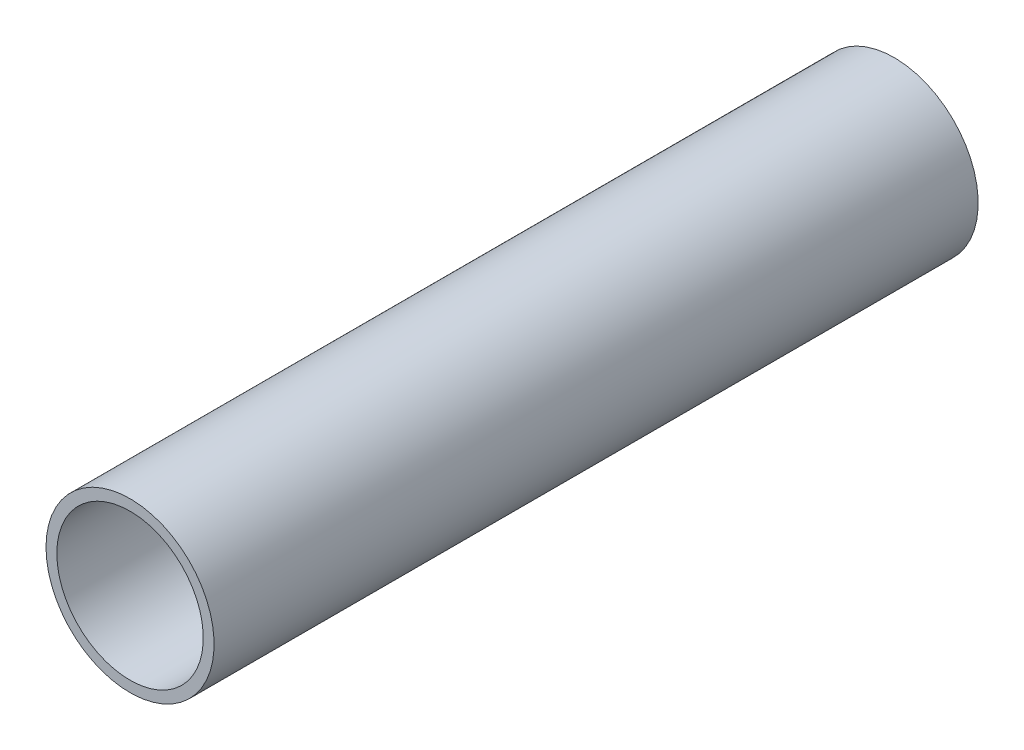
ISO-10303-21;
HEADER;
FILE_DESCRIPTION(('STEP AP214'),'2;1');
FILE_NAME('part.step','',(''),(''),'','','');
FILE_SCHEMA(('AUTOMOTIVE_DESIGN { 1 0 10303 214 1 1 1 1 }'));
ENDSEC;
DATA;
#1=APPLICATION_CONTEXT('core data for automotive mechanical design processes');
#2=APPLICATION_PROTOCOL_DEFINITION('international standard','automotive_design',2000,#1);
#3=PRODUCT_CONTEXT('',#1,'mechanical');
#4=PRODUCT('Part','Part','',(#3));
#5=PRODUCT_RELATED_PRODUCT_CATEGORY('part','',(#4));
#6=PRODUCT_DEFINITION_FORMATION('','',#4);
#7=PRODUCT_DEFINITION_CONTEXT('part definition',#1,'design');
#8=PRODUCT_DEFINITION('design','',#6,#7);
#9=PRODUCT_DEFINITION_SHAPE('','',#8);
#10=(LENGTH_UNIT() NAMED_UNIT(*) SI_UNIT(.MILLI.,.METRE.));
#11=(NAMED_UNIT(*) PLANE_ANGLE_UNIT() SI_UNIT($,.RADIAN.));
#12=(NAMED_UNIT(*) SI_UNIT($,.STERADIAN.) SOLID_ANGLE_UNIT());
#13=UNCERTAINTY_MEASURE_WITH_UNIT(LENGTH_MEASURE(1.E-05),#10,'distance_accuracy_value','');
#14=(GEOMETRIC_REPRESENTATION_CONTEXT(3) GLOBAL_UNCERTAINTY_ASSIGNED_CONTEXT((#13)) GLOBAL_UNIT_ASSIGNED_CONTEXT((#10,
#11,#12)) REPRESENTATION_CONTEXT('',''));
#15=CARTESIAN_POINT('',(0.,0.,0.));
#16=DIRECTION('',(0.,0.,1.));
#17=DIRECTION('',(1.,0.,0.));
#18=AXIS2_PLACEMENT_3D('',#15,#16,#17);
#19=CARTESIAN_POINT('',(0.,1.11022302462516E-13,152.4));
#20=DIRECTION('',(0.,0.,0.999999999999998));
#21=DIRECTION('',(1.,0.,0.));
#22=AXIS2_PLACEMENT_3D('',#19,#20,#21);
#23=PLANE('',#22);
#24=CARTESIAN_POINT('',(0.,1.11022302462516E-13,152.4));
#25=DIRECTION('',(0.,0.,0.999999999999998));
#26=DIRECTION('',(1.,0.,0.));
#27=AXIS2_PLACEMENT_3D('',#24,#25,#26);
#28=CIRCLE('',#27,16.764);
#29=CARTESIAN_POINT('',(-16.764,1.10557007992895E-13,152.4));
#30=VERTEX_POINT('',#29);
#31=EDGE_CURVE('E12',#30,#30,#28,.T.);
#32=ORIENTED_EDGE('',*,*,#31,.T.);
#33=EDGE_LOOP('',(#32));
#34=FACE_BOUND('',#33,.T.);
#35=CARTESIAN_POINT('',(0.,1.11022302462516E-13,152.4));
#36=DIRECTION('',(0.,0.,0.999999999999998));
#37=DIRECTION('',(1.,0.,0.));
#38=AXIS2_PLACEMENT_3D('',#35,#36,#37);
#39=CIRCLE('',#38,14.605);
#40=CARTESIAN_POINT('',(-14.605,1.10616932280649E-13,152.4));
#41=VERTEX_POINT('',#40);
#42=EDGE_CURVE('E58',#41,#41,#39,.T.);
#43=ORIENTED_EDGE('',*,*,#42,.F.);
#44=EDGE_LOOP('',(#43));
#45=FACE_BOUND('',#44,.T.);
#46=ADVANCED_FACE('F44',(#34,#45),#23,.T.);
#47=CARTESIAN_POINT('',(0.,0.,0.));
#48=DIRECTION('',(0.,0.,0.999999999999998));
#49=DIRECTION('',(1.,0.,0.));
#50=AXIS2_PLACEMENT_3D('',#47,#48,#49);
#51=PLANE('',#50);
#52=CARTESIAN_POINT('',(0.,0.,0.));
#53=DIRECTION('',(0.,0.,0.999999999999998));
#54=DIRECTION('',(1.,0.,0.));
#55=AXIS2_PLACEMENT_3D('',#52,#53,#54);
#56=CIRCLE('',#55,16.764);
#57=CARTESIAN_POINT('',(-16.764,1.10557007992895E-13,0.));
#58=VERTEX_POINT('',#57);
#59=EDGE_CURVE('E48',#58,#58,#56,.T.);
#60=ORIENTED_EDGE('',*,*,#59,.F.);
#61=EDGE_LOOP('',(#60));
#62=FACE_BOUND('',#61,.T.);
#63=CARTESIAN_POINT('',(0.,0.,0.));
#64=DIRECTION('',(0.,0.,0.999999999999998));
#65=DIRECTION('',(1.,0.,0.));
#66=AXIS2_PLACEMENT_3D('',#63,#64,#65);
#67=CIRCLE('',#66,14.605);
#68=CARTESIAN_POINT('',(-14.605,1.10616932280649E-13,0.));
#69=VERTEX_POINT('',#68);
#70=EDGE_CURVE('E60',#69,#69,#67,.T.);
#71=ORIENTED_EDGE('',*,*,#70,.T.);
#72=EDGE_LOOP('',(#71));
#73=FACE_BOUND('',#72,.T.);
#74=ADVANCED_FACE('F73',(#62,#73),#51,.F.);
#75=CARTESIAN_POINT('',(0.,1.11022302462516E-13,152.4));
#76=DIRECTION('',(0.,0.,-0.999999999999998));
#77=DIRECTION('',(-1.,0.,0.));
#78=AXIS2_PLACEMENT_3D('',#75,#76,#77);
#79=CYLINDRICAL_SURFACE('',#78,16.764);
#80=CARTESIAN_POINT('',(-16.764,1.10557007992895E-13,152.4));
#81=CARTESIAN_POINT('',(-16.764,1.10557007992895E-13,150.8125));
#82=CARTESIAN_POINT('',(-16.764,1.10557007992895E-13,149.225));
#83=CARTESIAN_POINT('',(-16.764,1.10557007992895E-13,146.05));
#84=CARTESIAN_POINT('',(-16.764,1.10557007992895E-13,144.4625));
#85=CARTESIAN_POINT('',(-16.764,1.10557007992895E-13,141.2875));
#86=CARTESIAN_POINT('',(-16.764,1.10557007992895E-13,139.7));
#87=CARTESIAN_POINT('',(-16.764,1.10557007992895E-13,136.525));
#88=CARTESIAN_POINT('',(-16.764,1.10557007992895E-13,134.9375));
#89=CARTESIAN_POINT('',(-16.764,1.10557007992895E-13,131.7625));
#90=CARTESIAN_POINT('',(-16.764,1.10557007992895E-13,130.175));
#91=CARTESIAN_POINT('',(-16.764,1.10557007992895E-13,127.));
#92=CARTESIAN_POINT('',(-16.764,1.10557007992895E-13,125.4125));
#93=CARTESIAN_POINT('',(-16.764,1.10557007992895E-13,122.2375));
#94=CARTESIAN_POINT('',(-16.764,1.10557007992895E-13,120.65));
#95=CARTESIAN_POINT('',(-16.764,1.10557007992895E-13,117.475));
#96=CARTESIAN_POINT('',(-16.764,1.10557007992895E-13,115.8875));
#97=CARTESIAN_POINT('',(-16.764,1.10557007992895E-13,112.7125));
#98=CARTESIAN_POINT('',(-16.764,1.10557007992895E-13,111.125));
#99=CARTESIAN_POINT('',(-16.764,1.10557007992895E-13,107.95));
#100=CARTESIAN_POINT('',(-16.764,1.10557007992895E-13,106.3625));
#101=CARTESIAN_POINT('',(-16.764,1.10557007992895E-13,103.1875));
#102=CARTESIAN_POINT('',(-16.764,1.10557007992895E-13,101.6));
#103=CARTESIAN_POINT('',(-16.764,1.10557007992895E-13,98.4249999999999));
#104=CARTESIAN_POINT('',(-16.764,1.10557007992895E-13,96.8374999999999));
#105=CARTESIAN_POINT('',(-16.764,1.10557007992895E-13,93.6625));
#106=CARTESIAN_POINT('',(-16.764,1.10557007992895E-13,92.0749999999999));
#107=CARTESIAN_POINT('',(-16.764,1.10557007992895E-13,88.8999999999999));
#108=CARTESIAN_POINT('',(-16.764,1.10557007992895E-13,87.3125));
#109=CARTESIAN_POINT('',(-16.764,1.10557007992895E-13,84.1375));
#110=CARTESIAN_POINT('',(-16.764,1.10557007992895E-13,82.55));
#111=CARTESIAN_POINT('',(-16.764,1.10557007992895E-13,79.375));
#112=CARTESIAN_POINT('',(-16.764,1.10557007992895E-13,77.7875));
#113=CARTESIAN_POINT('',(-16.764,1.10557007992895E-13,74.6125));
#114=CARTESIAN_POINT('',(-16.764,1.10557007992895E-13,73.025));
#115=CARTESIAN_POINT('',(-16.764,1.10557007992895E-13,69.85));
#116=CARTESIAN_POINT('',(-16.764,1.10557007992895E-13,68.2625));
#117=CARTESIAN_POINT('',(-16.764,1.10557007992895E-13,65.0875));
#118=CARTESIAN_POINT('',(-16.764,1.10557007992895E-13,63.5));
#119=CARTESIAN_POINT('',(-16.764,1.10557007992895E-13,60.325));
#120=CARTESIAN_POINT('',(-16.764,1.10557007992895E-13,58.7375));
#121=CARTESIAN_POINT('',(-16.764,1.10557007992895E-13,55.5625));
#122=CARTESIAN_POINT('',(-16.764,1.10557007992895E-13,53.975));
#123=CARTESIAN_POINT('',(-16.764,1.10557007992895E-13,50.8));
#124=CARTESIAN_POINT('',(-16.764,1.10557007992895E-13,49.2125));
#125=CARTESIAN_POINT('',(-16.764,1.10557007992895E-13,46.0375));
#126=CARTESIAN_POINT('',(-16.764,1.10557007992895E-13,44.45));
#127=CARTESIAN_POINT('',(-16.764,1.10557007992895E-13,41.275));
#128=CARTESIAN_POINT('',(-16.764,1.10557007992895E-13,39.6875));
#129=CARTESIAN_POINT('',(-16.764,1.10557007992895E-13,36.5125));
#130=CARTESIAN_POINT('',(-16.764,1.10557007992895E-13,34.925));
#131=CARTESIAN_POINT('',(-16.764,1.10557007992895E-13,31.75));
#132=CARTESIAN_POINT('',(-16.764,1.10557007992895E-13,30.1625));
#133=CARTESIAN_POINT('',(-16.764,1.10557007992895E-13,26.9875));
#134=CARTESIAN_POINT('',(-16.764,1.10557007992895E-13,25.4));
#135=CARTESIAN_POINT('',(-16.764,1.10557007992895E-13,22.225));
#136=CARTESIAN_POINT('',(-16.764,1.10557007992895E-13,20.6375));
#137=CARTESIAN_POINT('',(-16.764,1.10557007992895E-13,17.4625));
#138=CARTESIAN_POINT('',(-16.764,1.10557007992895E-13,15.875));
#139=CARTESIAN_POINT('',(-16.764,1.10557007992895E-13,12.7));
#140=CARTESIAN_POINT('',(-16.764,1.10557007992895E-13,11.1125));
#141=CARTESIAN_POINT('',(-16.764,1.10557007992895E-13,7.93750000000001));
#142=CARTESIAN_POINT('',(-16.764,1.10557007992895E-13,6.35));
#143=CARTESIAN_POINT('',(-16.764,1.10557007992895E-13,3.175));
#144=CARTESIAN_POINT('',(-16.764,1.10557007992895E-13,1.5875));
#145=CARTESIAN_POINT('',(-16.764,1.10557007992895E-13,0.));
#146=B_SPLINE_CURVE_WITH_KNOTS('',3,(#80,#81,#82,#83,#84,#85,#86,#87,#88,#89,#90,#91,#92,#93,
#94,#95,#96,#97,#98,#99,#100,#101,#102,#103,#104,#105,#106,#107,#108,#109,#110,#111,#112,#113,
#114,#115,#116,#117,#118,#119,#120,#121,#122,#123,#124,#125,#126,#127,#128,#129,#130,#131,#132,
#133,#134,#135,#136,#137,#138,#139,#140,#141,#142,#143,#144,#145),.UNSPECIFIED.,.F.,.F.,(4,2,2,
2,2,2,2,2,2,2,2,2,2,2,2,2,2,2,2,2,2,2,2,2,2,2,2,2,2,2,2,2,4),(0.,4.76249999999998,
9.52499999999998,14.2875,19.05,23.8125,28.575,33.3375,38.1,42.8625,47.6249999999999,
52.3874999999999,57.1499999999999,61.9124999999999,66.6749999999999,71.4374999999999,
76.1999999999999,80.9624999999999,85.7249999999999,90.4874999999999,95.2499999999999,100.0125,
104.775,109.5375,114.3,119.0625,123.825,128.5875,133.35,138.1125,142.875,147.6375,152.4),.UNSPECIFIED.);
#147=EDGE_CURVE('BSEAM46',#30,#58,#146,.T.);
#148=ORIENTED_EDGE('',*,*,#31,.F.);
#149=ORIENTED_EDGE('',*,*,#59,.T.);
#150=ORIENTED_EDGE('',*,*,#147,.T.);
#151=ORIENTED_EDGE('',*,*,#147,.F.);
#152=EDGE_LOOP('',(#148,#150,#149,#151));
#153=FACE_BOUND('',#152,.T.);
#154=ADVANCED_FACE('F46',(#153),#79,.T.);
#155=CARTESIAN_POINT('',(0.,1.11022302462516E-13,152.4));
#156=DIRECTION('',(0.,0.,-0.999999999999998));
#157=DIRECTION('',(-1.,0.,0.));
#158=AXIS2_PLACEMENT_3D('',#155,#156,#157);
#159=CYLINDRICAL_SURFACE('',#158,14.605);
#160=CARTESIAN_POINT('',(-14.605,1.10616932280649E-13,152.4));
#161=CARTESIAN_POINT('',(-14.605,1.10616932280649E-13,150.8125));
#162=CARTESIAN_POINT('',(-14.605,1.10616932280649E-13,149.225));
#163=CARTESIAN_POINT('',(-14.605,1.10616932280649E-13,146.05));
#164=CARTESIAN_POINT('',(-14.605,1.10616932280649E-13,144.4625));
#165=CARTESIAN_POINT('',(-14.605,1.10616932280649E-13,141.2875));
#166=CARTESIAN_POINT('',(-14.605,1.10616932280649E-13,139.7));
#167=CARTESIAN_POINT('',(-14.605,1.10616932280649E-13,136.525));
#168=CARTESIAN_POINT('',(-14.605,1.10616932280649E-13,134.9375));
#169=CARTESIAN_POINT('',(-14.605,1.10616932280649E-13,131.7625));
#170=CARTESIAN_POINT('',(-14.605,1.10616932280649E-13,130.175));
#171=CARTESIAN_POINT('',(-14.605,1.10616932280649E-13,127.));
#172=CARTESIAN_POINT('',(-14.605,1.10616932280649E-13,125.4125));
#173=CARTESIAN_POINT('',(-14.605,1.10616932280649E-13,122.2375));
#174=CARTESIAN_POINT('',(-14.605,1.10616932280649E-13,120.65));
#175=CARTESIAN_POINT('',(-14.605,1.10616932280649E-13,117.475));
#176=CARTESIAN_POINT('',(-14.605,1.10616932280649E-13,115.8875));
#177=CARTESIAN_POINT('',(-14.605,1.10616932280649E-13,112.7125));
#178=CARTESIAN_POINT('',(-14.605,1.10616932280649E-13,111.125));
#179=CARTESIAN_POINT('',(-14.605,1.10616932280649E-13,107.95));
#180=CARTESIAN_POINT('',(-14.605,1.10616932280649E-13,106.3625));
#181=CARTESIAN_POINT('',(-14.605,1.10616932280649E-13,103.1875));
#182=CARTESIAN_POINT('',(-14.605,1.10616932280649E-13,101.6));
#183=CARTESIAN_POINT('',(-14.605,1.10616932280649E-13,98.4249999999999));
#184=CARTESIAN_POINT('',(-14.605,1.10616932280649E-13,96.8374999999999));
#185=CARTESIAN_POINT('',(-14.605,1.10616932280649E-13,93.6625));
#186=CARTESIAN_POINT('',(-14.605,1.10616932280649E-13,92.0749999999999));
#187=CARTESIAN_POINT('',(-14.605,1.10616932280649E-13,88.8999999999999));
#188=CARTESIAN_POINT('',(-14.605,1.10616932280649E-13,87.3125));
#189=CARTESIAN_POINT('',(-14.605,1.10616932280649E-13,84.1375));
#190=CARTESIAN_POINT('',(-14.605,1.10616932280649E-13,82.55));
#191=CARTESIAN_POINT('',(-14.605,1.10616932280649E-13,79.375));
#192=CARTESIAN_POINT('',(-14.605,1.10616932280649E-13,77.7875));
#193=CARTESIAN_POINT('',(-14.605,1.10616932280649E-13,74.6125));
#194=CARTESIAN_POINT('',(-14.605,1.10616932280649E-13,73.025));
#195=CARTESIAN_POINT('',(-14.605,1.10616932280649E-13,69.85));
#196=CARTESIAN_POINT('',(-14.605,1.10616932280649E-13,68.2625));
#197=CARTESIAN_POINT('',(-14.605,1.10616932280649E-13,65.0875));
#198=CARTESIAN_POINT('',(-14.605,1.10616932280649E-13,63.5));
#199=CARTESIAN_POINT('',(-14.605,1.10616932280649E-13,60.325));
#200=CARTESIAN_POINT('',(-14.605,1.10616932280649E-13,58.7375));
#201=CARTESIAN_POINT('',(-14.605,1.10616932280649E-13,55.5625));
#202=CARTESIAN_POINT('',(-14.605,1.10616932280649E-13,53.975));
#203=CARTESIAN_POINT('',(-14.605,1.10616932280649E-13,50.8));
#204=CARTESIAN_POINT('',(-14.605,1.10616932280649E-13,49.2125));
#205=CARTESIAN_POINT('',(-14.605,1.10616932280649E-13,46.0375));
#206=CARTESIAN_POINT('',(-14.605,1.10616932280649E-13,44.45));
#207=CARTESIAN_POINT('',(-14.605,1.10616932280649E-13,41.275));
#208=CARTESIAN_POINT('',(-14.605,1.10616932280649E-13,39.6875));
#209=CARTESIAN_POINT('',(-14.605,1.10616932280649E-13,36.5125));
#210=CARTESIAN_POINT('',(-14.605,1.10616932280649E-13,34.925));
#211=CARTESIAN_POINT('',(-14.605,1.10616932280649E-13,31.75));
#212=CARTESIAN_POINT('',(-14.605,1.10616932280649E-13,30.1625));
#213=CARTESIAN_POINT('',(-14.605,1.10616932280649E-13,26.9875));
#214=CARTESIAN_POINT('',(-14.605,1.10616932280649E-13,25.4));
#215=CARTESIAN_POINT('',(-14.605,1.10616932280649E-13,22.225));
#216=CARTESIAN_POINT('',(-14.605,1.10616932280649E-13,20.6375));
#217=CARTESIAN_POINT('',(-14.605,1.10616932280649E-13,17.4625));
#218=CARTESIAN_POINT('',(-14.605,1.10616932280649E-13,15.875));
#219=CARTESIAN_POINT('',(-14.605,1.10616932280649E-13,12.7));
#220=CARTESIAN_POINT('',(-14.605,1.10616932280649E-13,11.1125));
#221=CARTESIAN_POINT('',(-14.605,1.10616932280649E-13,7.93750000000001));
#222=CARTESIAN_POINT('',(-14.605,1.10616932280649E-13,6.35));
#223=CARTESIAN_POINT('',(-14.605,1.10616932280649E-13,3.175));
#224=CARTESIAN_POINT('',(-14.605,1.10616932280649E-13,1.5875));
#225=CARTESIAN_POINT('',(-14.605,1.10616932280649E-13,0.));
#226=B_SPLINE_CURVE_WITH_KNOTS('',3,(#160,#161,#162,#163,#164,#165,#166,#167,#168,#169,#170,
#171,#172,#173,#174,#175,#176,#177,#178,#179,#180,#181,#182,#183,#184,#185,#186,#187,#188,#189,
#190,#191,#192,#193,#194,#195,#196,#197,#198,#199,#200,#201,#202,#203,#204,#205,#206,#207,#208,
#209,#210,#211,#212,#213,#214,#215,#216,#217,#218,#219,#220,#221,#222,#223,#224,#225),
.UNSPECIFIED.,.F.,.F.,(4,2,2,2,2,2,2,2,2,2,2,2,2,2,2,2,2,2,2,2,2,2,2,2,2,2,2,2,2,2,2,2,4),(0.,
4.76249999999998,9.52499999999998,14.2875,19.05,23.8125,28.575,33.3375,38.1,42.8625,
47.6249999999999,52.3874999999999,57.1499999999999,61.9124999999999,66.6749999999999,
71.4374999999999,76.1999999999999,80.9624999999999,85.7249999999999,90.4874999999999,
95.2499999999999,100.0125,104.775,109.5375,114.3,119.0625,123.825,128.5875,133.35,138.1125,
142.875,147.6375,152.4),.UNSPECIFIED.);
#227=EDGE_CURVE('BSEAM69',#41,#69,#226,.T.);
#228=ORIENTED_EDGE('',*,*,#42,.T.);
#229=ORIENTED_EDGE('',*,*,#70,.F.);
#230=ORIENTED_EDGE('',*,*,#227,.T.);
#231=ORIENTED_EDGE('',*,*,#227,.F.);
#232=EDGE_LOOP('',(#228,#230,#229,#231));
#233=FACE_BOUND('',#232,.T.);
#234=ADVANCED_FACE('F69',(#233),#159,.F.);
#235=CLOSED_SHELL('',(#46,#74,#154,#234));
#236=MANIFOLD_SOLID_BREP('B2',#235);
#237=ADVANCED_BREP_SHAPE_REPRESENTATION('',(#18,#236),#14);
#238=SHAPE_DEFINITION_REPRESENTATION(#9,#237);
ENDSEC;
END-ISO-10303-21;
